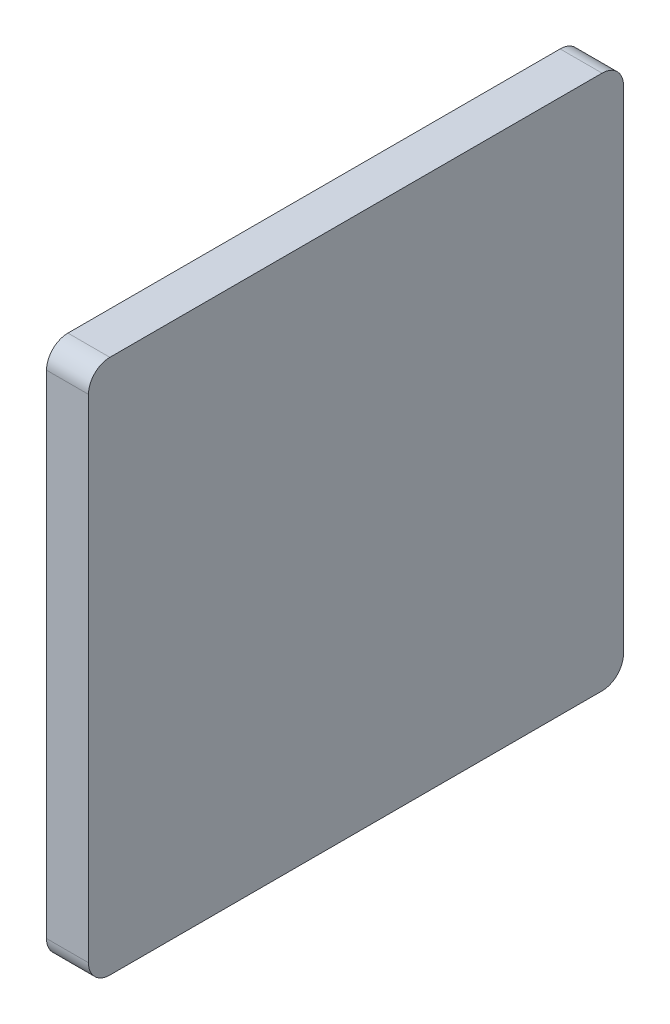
ISO-10303-21;
HEADER;
FILE_DESCRIPTION(('STEP AP214'),'2;1');
FILE_NAME('part.step','',(''),(''),'','','');
FILE_SCHEMA(('AUTOMOTIVE_DESIGN { 1 0 10303 214 1 1 1 1 }'));
ENDSEC;
DATA;
#1=APPLICATION_CONTEXT('core data for automotive mechanical design processes');
#2=APPLICATION_PROTOCOL_DEFINITION('international standard','automotive_design',2000,#1);
#3=PRODUCT_CONTEXT('',#1,'mechanical');
#4=PRODUCT('Part','Part','',(#3));
#5=PRODUCT_RELATED_PRODUCT_CATEGORY('part','',(#4));
#6=PRODUCT_DEFINITION_FORMATION('','',#4);
#7=PRODUCT_DEFINITION_CONTEXT('part definition',#1,'design');
#8=PRODUCT_DEFINITION('design','',#6,#7);
#9=PRODUCT_DEFINITION_SHAPE('','',#8);
#10=(LENGTH_UNIT() NAMED_UNIT(*) SI_UNIT(.MILLI.,.METRE.));
#11=(NAMED_UNIT(*) PLANE_ANGLE_UNIT() SI_UNIT($,.RADIAN.));
#12=(NAMED_UNIT(*) SI_UNIT($,.STERADIAN.) SOLID_ANGLE_UNIT());
#13=UNCERTAINTY_MEASURE_WITH_UNIT(LENGTH_MEASURE(1.E-05),#10,'distance_accuracy_value','');
#14=(GEOMETRIC_REPRESENTATION_CONTEXT(3) GLOBAL_UNCERTAINTY_ASSIGNED_CONTEXT((#13)) GLOBAL_UNIT_ASSIGNED_CONTEXT((#10,
#11,#12)) REPRESENTATION_CONTEXT('',''));
#15=CARTESIAN_POINT('',(0.,0.,0.));
#16=DIRECTION('',(0.,0.,1.));
#17=DIRECTION('',(1.,0.,0.));
#18=AXIS2_PLACEMENT_3D('',#15,#16,#17);
#19=CARTESIAN_POINT('',(309.200000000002,0.,49.9999999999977));
#20=DIRECTION('',(-1.,0.,0.));
#21=DIRECTION('',(0.,-1.,0.));
#22=AXIS2_PLACEMENT_3D('',#19,#20,#21);
#23=PLANE('',#22);
#24=CARTESIAN_POINT('',(309.200000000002,-57.5000000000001,55.));
#25=DIRECTION('',(-1.,0.,0.));
#26=DIRECTION('',(0.,0.,1.));
#27=AXIS2_PLACEMENT_3D('',#24,#25,#26);
#28=CIRCLE('',#27,4.99999999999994);
#29=CARTESIAN_POINT('',(309.200000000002,-57.5000000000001,49.9999999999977));
#30=VERTEX_POINT('',#29);
#31=CARTESIAN_POINT('',(309.200000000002,-62.5,55.));
#32=VERTEX_POINT('',#31);
#33=EDGE_CURVE('E84',#30,#32,#28,.T.);
#34=ORIENTED_EDGE('',*,*,#33,.T.);
#35=DIRECTION('',(0.,0.,1.));
#36=VECTOR('',#35,1.);
#37=CARTESIAN_POINT('',(309.200000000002,-62.5,112.500000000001));
#38=LINE('',#37,#36);
#39=CARTESIAN_POINT('',(309.200000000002,-62.5,170.000000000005));
#40=VERTEX_POINT('',#39);
#41=EDGE_CURVE('E79',#32,#40,#38,.T.);
#42=ORIENTED_EDGE('',*,*,#41,.T.);
#43=CARTESIAN_POINT('',(309.200000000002,-57.5,170.000000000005));
#44=DIRECTION('',(-1.,0.,0.));
#45=DIRECTION('',(0.,0.,1.));
#46=AXIS2_PLACEMENT_3D('',#43,#44,#45);
#47=CIRCLE('',#46,5.);
#48=CARTESIAN_POINT('',(309.200000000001,-57.5,175.000000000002));
#49=VERTEX_POINT('',#48);
#50=EDGE_CURVE('E20',#40,#49,#47,.T.);
#51=ORIENTED_EDGE('',*,*,#50,.T.);
#52=DIRECTION('',(0.,-1.,0.));
#53=VECTOR('',#52,1.);
#54=CARTESIAN_POINT('',(309.199999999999,0.,175.000000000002));
#55=LINE('',#54,#53);
#56=CARTESIAN_POINT('',(309.199999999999,57.5,175.000000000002));
#57=VERTEX_POINT('',#56);
#58=EDGE_CURVE('E105',#57,#49,#55,.T.);
#59=ORIENTED_EDGE('',*,*,#58,.F.);
#60=CARTESIAN_POINT('',(309.199999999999,57.4999999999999,170.000000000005));
#61=DIRECTION('',(-1.,0.,0.));
#62=DIRECTION('',(0.,0.,1.));
#63=AXIS2_PLACEMENT_3D('',#60,#61,#62);
#64=CIRCLE('',#63,5.00000000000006);
#65=CARTESIAN_POINT('',(309.199999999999,62.5,170.000000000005));
#66=VERTEX_POINT('',#65);
#67=EDGE_CURVE('E127',#57,#66,#64,.T.);
#68=ORIENTED_EDGE('',*,*,#67,.T.);
#69=DIRECTION('',(0.,0.,1.));
#70=VECTOR('',#69,1.);
#71=CARTESIAN_POINT('',(309.199999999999,62.5,112.500000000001));
#72=LINE('',#71,#70);
#73=CARTESIAN_POINT('',(309.199999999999,62.5,55.));
#74=VERTEX_POINT('',#73);
#75=EDGE_CURVE('E108',#74,#66,#72,.T.);
#76=ORIENTED_EDGE('',*,*,#75,.F.);
#77=CARTESIAN_POINT('',(309.199999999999,57.5,55.));
#78=DIRECTION('',(-1.,0.,0.));
#79=DIRECTION('',(0.,0.,1.));
#80=AXIS2_PLACEMENT_3D('',#77,#78,#79);
#81=CIRCLE('',#80,5.);
#82=CARTESIAN_POINT('',(309.200000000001,57.5,49.9999999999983));
#83=VERTEX_POINT('',#82);
#84=EDGE_CURVE('E130',#74,#83,#81,.T.);
#85=ORIENTED_EDGE('',*,*,#84,.T.);
#86=DIRECTION('',(0.,1.,0.));
#87=VECTOR('',#86,1.);
#88=CARTESIAN_POINT('',(309.200000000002,0.,49.9999999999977));
#89=LINE('',#88,#87);
#90=EDGE_CURVE('E112',#30,#83,#89,.T.);
#91=ORIENTED_EDGE('',*,*,#90,.F.);
#92=EDGE_LOOP('',(#34,#42,#51,#59,#68,#76,#85,#91));
#93=FACE_BOUND('',#92,.T.);
#94=ADVANCED_FACE('F16',(#93),#23,.T.);
#95=CARTESIAN_POINT('',(319.,-57.5,170.000000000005));
#96=DIRECTION('',(-1.,0.,0.));
#97=DIRECTION('',(0.,0.,1.));
#98=AXIS2_PLACEMENT_3D('',#95,#96,#97);
#99=CYLINDRICAL_SURFACE('',#98,5.);
#100=DIRECTION('',(1.,0.,0.));
#101=VECTOR('',#100,1.);
#102=CARTESIAN_POINT('',(314.100000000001,-62.5,170.000000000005));
#103=LINE('',#102,#101);
#104=CARTESIAN_POINT('',(319.,-62.5,170.000000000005));
#105=VERTEX_POINT('',#104);
#106=EDGE_CURVE('E88',#40,#105,#103,.T.);
#107=ORIENTED_EDGE('',*,*,#106,.T.);
#108=CARTESIAN_POINT('',(319.,-57.5,170.000000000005));
#109=DIRECTION('',(-1.,0.,0.));
#110=DIRECTION('',(0.,0.,1.));
#111=AXIS2_PLACEMENT_3D('',#108,#109,#110);
#112=CIRCLE('',#111,5.);
#113=CARTESIAN_POINT('',(319.,-57.5,175.000000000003));
#114=VERTEX_POINT('',#113);
#115=EDGE_CURVE('E107',#114,#105,#112,.F.);
#116=ORIENTED_EDGE('',*,*,#115,.F.);
#117=DIRECTION('',(1.,0.,0.));
#118=VECTOR('',#117,1.);
#119=CARTESIAN_POINT('',(309.199999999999,-57.5,175.000000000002));
#120=LINE('',#119,#118);
#121=EDGE_CURVE('E94',#49,#114,#120,.T.);
#122=ORIENTED_EDGE('',*,*,#121,.F.);
#123=ORIENTED_EDGE('',*,*,#50,.F.);
#124=EDGE_LOOP('',(#107,#116,#122,#123));
#125=FACE_BOUND('',#124,.T.);
#126=ADVANCED_FACE('F91',(#125),#99,.T.);
#127=CARTESIAN_POINT('',(314.100000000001,-62.5,112.500000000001));
#128=DIRECTION('',(0.,1.,0.));
#129=DIRECTION('',(0.,0.,1.));
#130=AXIS2_PLACEMENT_3D('',#127,#128,#129);
#131=PLANE('',#130);
#132=ORIENTED_EDGE('',*,*,#41,.F.);
#133=DIRECTION('',(-1.,0.,0.));
#134=VECTOR('',#133,1.);
#135=CARTESIAN_POINT('',(319.,-62.5,55.));
#136=LINE('',#135,#134);
#137=CARTESIAN_POINT('',(319.,-62.5,55.));
#138=VERTEX_POINT('',#137);
#139=EDGE_CURVE('E100',#32,#138,#136,.F.);
#140=ORIENTED_EDGE('',*,*,#139,.T.);
#141=DIRECTION('',(0.,0.,1.));
#142=VECTOR('',#141,1.);
#143=CARTESIAN_POINT('',(319.000000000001,-62.5,97.4999999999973));
#144=LINE('',#143,#142);
#145=EDGE_CURVE('E98',#105,#138,#144,.F.);
#146=ORIENTED_EDGE('',*,*,#145,.F.);
#147=ORIENTED_EDGE('',*,*,#106,.F.);
#148=EDGE_LOOP('',(#132,#140,#146,#147));
#149=FACE_BOUND('',#148,.T.);
#150=ADVANCED_FACE('F96',(#149),#131,.F.);
#151=CARTESIAN_POINT('',(319.,-57.5000000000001,55.));
#152=DIRECTION('',(-1.,0.,0.));
#153=DIRECTION('',(0.,0.,1.));
#154=AXIS2_PLACEMENT_3D('',#151,#152,#153);
#155=CYLINDRICAL_SURFACE('',#154,4.99999999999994);
#156=DIRECTION('',(1.,0.,0.));
#157=VECTOR('',#156,1.);
#158=CARTESIAN_POINT('',(319.000000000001,-57.5,49.9999999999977));
#159=LINE('',#158,#157);
#160=CARTESIAN_POINT('',(319.,-57.5000000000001,49.9999999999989));
#161=VERTEX_POINT('',#160);
#162=EDGE_CURVE('E114',#161,#30,#159,.F.);
#163=ORIENTED_EDGE('',*,*,#162,.F.);
#164=CARTESIAN_POINT('',(319.,-57.5000000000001,55.));
#165=DIRECTION('',(-1.,0.,0.));
#166=DIRECTION('',(0.,0.,1.));
#167=AXIS2_PLACEMENT_3D('',#164,#165,#166);
#168=CIRCLE('',#167,4.99999999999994);
#169=EDGE_CURVE('E123',#138,#161,#168,.F.);
#170=ORIENTED_EDGE('',*,*,#169,.F.);
#171=ORIENTED_EDGE('',*,*,#139,.F.);
#172=ORIENTED_EDGE('',*,*,#33,.F.);
#173=EDGE_LOOP('',(#163,#170,#171,#172));
#174=FACE_BOUND('',#173,.T.);
#175=ADVANCED_FACE('F177',(#174),#155,.T.);
#176=CARTESIAN_POINT('',(319.000000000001,0.,49.9999999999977));
#177=DIRECTION('',(0.,0.,-1.));
#178=DIRECTION('',(0.,1.,0.));
#179=AXIS2_PLACEMENT_3D('',#176,#177,#178);
#180=PLANE('',#179);
#181=DIRECTION('',(-1.,0.,0.));
#182=VECTOR('',#181,1.);
#183=CARTESIAN_POINT('',(319.,57.5,50.));
#184=LINE('',#183,#182);
#185=CARTESIAN_POINT('',(319.,57.5,50.));
#186=VERTEX_POINT('',#185);
#187=EDGE_CURVE('E113',#83,#186,#184,.F.);
#188=ORIENTED_EDGE('',*,*,#187,.T.);
#189=DIRECTION('',(0.,1.,0.));
#190=VECTOR('',#189,1.);
#191=CARTESIAN_POINT('',(319.000000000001,0.,50.));
#192=LINE('',#191,#190);
#193=EDGE_CURVE('E122',#161,#186,#192,.T.);
#194=ORIENTED_EDGE('',*,*,#193,.F.);
#195=ORIENTED_EDGE('',*,*,#162,.T.);
#196=ORIENTED_EDGE('',*,*,#90,.T.);
#197=EDGE_LOOP('',(#188,#194,#195,#196));
#198=FACE_BOUND('',#197,.T.);
#199=ADVANCED_FACE('F172',(#198),#180,.T.);
#200=CARTESIAN_POINT('',(319.,57.5,55.));
#201=DIRECTION('',(-1.,0.,0.));
#202=DIRECTION('',(0.,0.,1.));
#203=AXIS2_PLACEMENT_3D('',#200,#201,#202);
#204=CYLINDRICAL_SURFACE('',#203,5.);
#205=DIRECTION('',(1.,0.,0.));
#206=VECTOR('',#205,1.);
#207=CARTESIAN_POINT('',(314.100000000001,62.5,55.));
#208=LINE('',#207,#206);
#209=CARTESIAN_POINT('',(319.,62.5,55.));
#210=VERTEX_POINT('',#209);
#211=EDGE_CURVE('E111',#210,#74,#208,.F.);
#212=ORIENTED_EDGE('',*,*,#211,.F.);
#213=CARTESIAN_POINT('',(319.,57.5,55.));
#214=DIRECTION('',(-1.,0.,0.));
#215=DIRECTION('',(0.,0.,1.));
#216=AXIS2_PLACEMENT_3D('',#213,#214,#215);
#217=CIRCLE('',#216,5.);
#218=EDGE_CURVE('E119',#186,#210,#217,.F.);
#219=ORIENTED_EDGE('',*,*,#218,.F.);
#220=ORIENTED_EDGE('',*,*,#187,.F.);
#221=ORIENTED_EDGE('',*,*,#84,.F.);
#222=EDGE_LOOP('',(#212,#219,#220,#221));
#223=FACE_BOUND('',#222,.T.);
#224=ADVANCED_FACE('F162',(#223),#204,.T.);
#225=CARTESIAN_POINT('',(314.100000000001,62.5,112.500000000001));
#226=DIRECTION('',(0.,1.,0.));
#227=DIRECTION('',(0.,0.,1.));
#228=AXIS2_PLACEMENT_3D('',#225,#226,#227);
#229=PLANE('',#228);
#230=DIRECTION('',(-1.,0.,0.));
#231=VECTOR('',#230,1.);
#232=CARTESIAN_POINT('',(319.,62.5,170.000000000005));
#233=LINE('',#232,#231);
#234=CARTESIAN_POINT('',(319.,62.5,170.000000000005));
#235=VERTEX_POINT('',#234);
#236=EDGE_CURVE('E110',#66,#235,#233,.F.);
#237=ORIENTED_EDGE('',*,*,#236,.T.);
#238=DIRECTION('',(0.,0.,1.));
#239=VECTOR('',#238,1.);
#240=CARTESIAN_POINT('',(319.000000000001,62.5,97.4999999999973));
#241=LINE('',#240,#239);
#242=EDGE_CURVE('E118',#210,#235,#241,.T.);
#243=ORIENTED_EDGE('',*,*,#242,.F.);
#244=ORIENTED_EDGE('',*,*,#211,.T.);
#245=ORIENTED_EDGE('',*,*,#75,.T.);
#246=EDGE_LOOP('',(#237,#243,#244,#245));
#247=FACE_BOUND('',#246,.T.);
#248=ADVANCED_FACE('F150',(#247),#229,.T.);
#249=CARTESIAN_POINT('',(319.,57.4999999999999,170.000000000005));
#250=DIRECTION('',(-1.,0.,0.));
#251=DIRECTION('',(0.,0.,1.));
#252=AXIS2_PLACEMENT_3D('',#249,#250,#251);
#253=CYLINDRICAL_SURFACE('',#252,5.00000000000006);
#254=DIRECTION('',(1.,0.,0.));
#255=VECTOR('',#254,1.);
#256=CARTESIAN_POINT('',(309.199999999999,57.5,175.000000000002));
#257=LINE('',#256,#255);
#258=CARTESIAN_POINT('',(319.,57.5,175.000000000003));
#259=VERTEX_POINT('',#258);
#260=EDGE_CURVE('E35',#259,#57,#257,.F.);
#261=ORIENTED_EDGE('',*,*,#260,.F.);
#262=CARTESIAN_POINT('',(319.,57.4999999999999,170.000000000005));
#263=DIRECTION('',(-1.,0.,0.));
#264=DIRECTION('',(0.,0.,1.));
#265=AXIS2_PLACEMENT_3D('',#262,#263,#264);
#266=CIRCLE('',#265,5.00000000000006);
#267=EDGE_CURVE('E26',#235,#259,#266,.F.);
#268=ORIENTED_EDGE('',*,*,#267,.F.);
#269=ORIENTED_EDGE('',*,*,#236,.F.);
#270=ORIENTED_EDGE('',*,*,#67,.F.);
#271=EDGE_LOOP('',(#261,#268,#269,#270));
#272=FACE_BOUND('',#271,.T.);
#273=ADVANCED_FACE('F153',(#272),#253,.T.);
#274=CARTESIAN_POINT('',(309.199999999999,0.,175.000000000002));
#275=DIRECTION('',(0.,0.,1.));
#276=DIRECTION('',(0.,-1.,0.));
#277=AXIS2_PLACEMENT_3D('',#274,#275,#276);
#278=PLANE('',#277);
#279=ORIENTED_EDGE('',*,*,#260,.T.);
#280=ORIENTED_EDGE('',*,*,#58,.T.);
#281=ORIENTED_EDGE('',*,*,#121,.T.);
#282=DIRECTION('',(0.,1.,0.));
#283=VECTOR('',#282,1.);
#284=CARTESIAN_POINT('',(319.000000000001,0.,175.000000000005));
#285=LINE('',#284,#283);
#286=EDGE_CURVE('E10',#259,#114,#285,.F.);
#287=ORIENTED_EDGE('',*,*,#286,.F.);
#288=EDGE_LOOP('',(#279,#280,#281,#287));
#289=FACE_BOUND('',#288,.T.);
#290=ADVANCED_FACE('F155',(#289),#278,.T.);
#291=CARTESIAN_POINT('',(319.000000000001,0.,97.4999999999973));
#292=DIRECTION('',(1.,0.,0.));
#293=DIRECTION('',(0.,1.,0.));
#294=AXIS2_PLACEMENT_3D('',#291,#292,#293);
#295=PLANE('',#294);
#296=ORIENTED_EDGE('',*,*,#267,.T.);
#297=ORIENTED_EDGE('',*,*,#286,.T.);
#298=ORIENTED_EDGE('',*,*,#115,.T.);
#299=ORIENTED_EDGE('',*,*,#145,.T.);
#300=ORIENTED_EDGE('',*,*,#169,.T.);
#301=ORIENTED_EDGE('',*,*,#193,.T.);
#302=ORIENTED_EDGE('',*,*,#218,.T.);
#303=ORIENTED_EDGE('',*,*,#242,.T.);
#304=EDGE_LOOP('',(#296,#297,#298,#299,#300,#301,#302,#303));
#305=FACE_BOUND('',#304,.T.);
#306=ADVANCED_FACE('F18',(#305),#295,.T.);
#307=CLOSED_SHELL('',(#94,#126,#150,#175,#199,#224,#248,#273,#290,#306));
#308=MANIFOLD_SOLID_BREP('B1',#307);
#309=ADVANCED_BREP_SHAPE_REPRESENTATION('',(#18,#308),#14);
#310=SHAPE_DEFINITION_REPRESENTATION(#9,#309);
ENDSEC;
END-ISO-10303-21;
